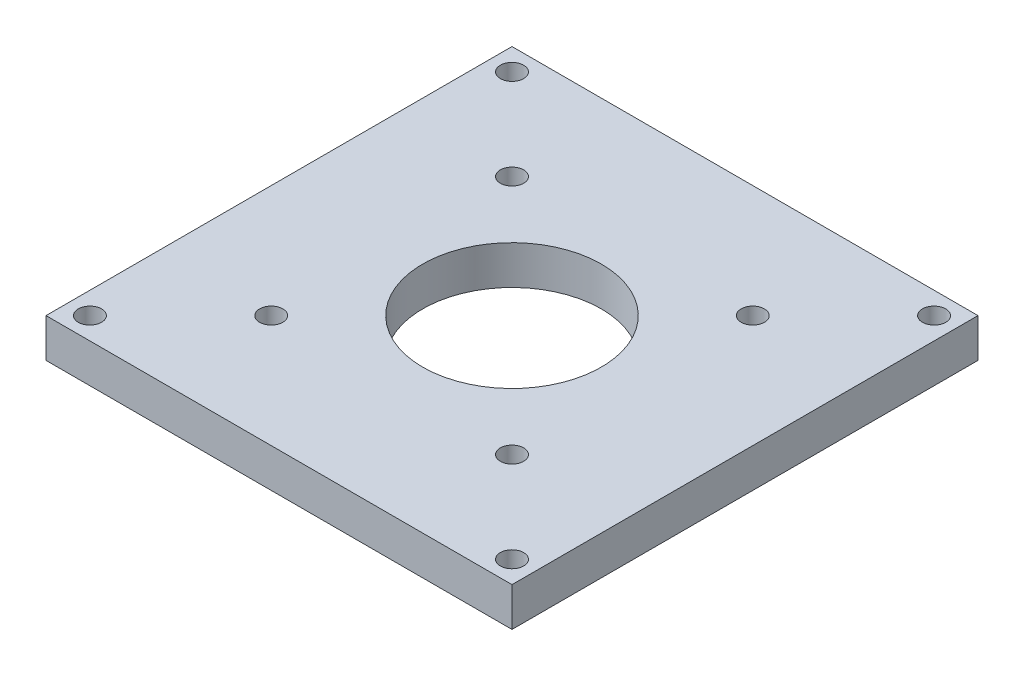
from build123d import *

# Parameters (mm, degrees)
SKETCH2_W           = 60
SKETCH2_H           = 60
BOSS_EXTRUDE1_DEPTH = 5
SKETCH3_R           = 11.5
SKETCH3_R_2         = 1.5
CUT_EXTRUDE1_DEPTH  = 86


with BuildPart() as part:
    # Sketch2 → Boss-Extrude1 (new body)
    with BuildSketch(Plane(origin=(0, 0, 0), x_dir=(1, 0, 0), z_dir=(0, 1, 0))):
        with Locations((30, 30)):
            Rectangle(SKETCH2_W, SKETCH2_H)
    extrude(amount=BOSS_EXTRUDE1_DEPTH)

    # Sketch3 → Cut-Extrude1 (cut, through all)
    with BuildSketch(Plane(origin=(0, 5, 0), x_dir=(1, 0, 0), z_dir=(0, 1, 0))):
        with Locations(Location((30, 30, 0), (0, 0, 270))):
            Circle(SKETCH3_R)
        with Locations(Location((14.5, 45.5, 0), (0, 0, 270))):
            Circle(SKETCH3_R_2)
        with Locations(Location((45.5, 45.5, 0), (0, 0, 270))):
            Circle(SKETCH3_R_2)
        with Locations(Location((45.5, 14.5, 0), (0, 0, 270))):
            Circle(SKETCH3_R_2)
        with Locations(Location((14.5, 14.5, 0), (0, 0, 270))):
            Circle(SKETCH3_R_2)
        with Locations(Location((2.828427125, 57.171572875, 0), (0, 0, 270))):
            Circle(SKETCH3_R_2)
        with Locations(Location((57.171572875, 57.171572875, 0), (0, 0, 270))):
            Circle(SKETCH3_R_2)
        with Locations(Location((57.171572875, 2.828427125, 0), (0, 0, 270))):
            Circle(SKETCH3_R_2)
        with Locations(Location((2.828427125, 2.828427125, 0), (0, 0, 270))):
            Circle(SKETCH3_R_2)
    extrude(amount=-CUT_EXTRUDE1_DEPTH, mode=Mode.SUBTRACT)


solid = part.part
